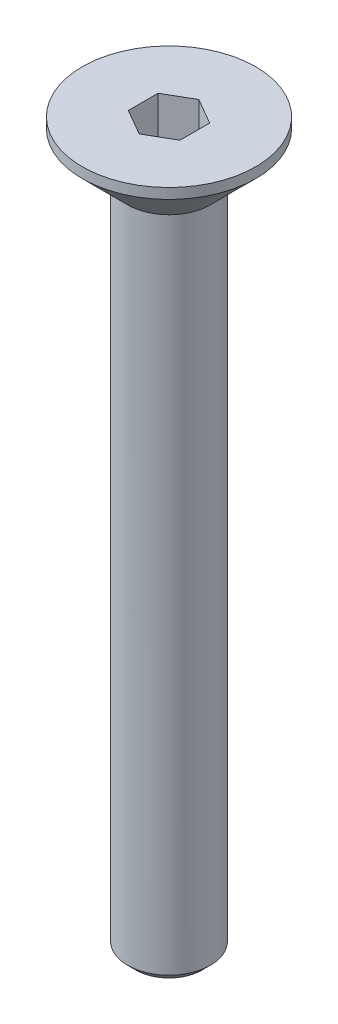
ISO-10303-21;
HEADER;
FILE_DESCRIPTION(('STEP AP214'),'2;1');
FILE_NAME('part.step','',(''),(''),'','','');
FILE_SCHEMA(('AUTOMOTIVE_DESIGN { 1 0 10303 214 1 1 1 1 }'));
ENDSEC;
DATA;
#1=APPLICATION_CONTEXT('core data for automotive mechanical design processes');
#2=APPLICATION_PROTOCOL_DEFINITION('international standard','automotive_design',2000,#1);
#3=PRODUCT_CONTEXT('',#1,'mechanical');
#4=PRODUCT('Part','Part','',(#3));
#5=PRODUCT_RELATED_PRODUCT_CATEGORY('part','',(#4));
#6=PRODUCT_DEFINITION_FORMATION('','',#4);
#7=PRODUCT_DEFINITION_CONTEXT('part definition',#1,'design');
#8=PRODUCT_DEFINITION('design','',#6,#7);
#9=PRODUCT_DEFINITION_SHAPE('','',#8);
#10=(LENGTH_UNIT() NAMED_UNIT(*) SI_UNIT(.MILLI.,.METRE.));
#11=(NAMED_UNIT(*) PLANE_ANGLE_UNIT() SI_UNIT($,.RADIAN.));
#12=(NAMED_UNIT(*) SI_UNIT($,.STERADIAN.) SOLID_ANGLE_UNIT());
#13=UNCERTAINTY_MEASURE_WITH_UNIT(LENGTH_MEASURE(1.E-05),#10,'distance_accuracy_value','');
#14=(GEOMETRIC_REPRESENTATION_CONTEXT(3) GLOBAL_UNCERTAINTY_ASSIGNED_CONTEXT((#13)) GLOBAL_UNIT_ASSIGNED_CONTEXT((#10,
#11,#12)) REPRESENTATION_CONTEXT('',''));
#15=CARTESIAN_POINT('',(0.,0.,0.));
#16=DIRECTION('',(0.,0.,1.));
#17=DIRECTION('',(1.,0.,0.));
#18=AXIS2_PLACEMENT_3D('',#15,#16,#17);
#19=CARTESIAN_POINT('',(-1.25,0.,0.721687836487));
#20=DIRECTION('',(-0.500000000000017,0.,0.866025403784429));
#21=DIRECTION('',(0.866025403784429,0.,0.500000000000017));
#22=AXIS2_PLACEMENT_3D('',#19,#20,#21);
#23=PLANE('',#22);
#24=DIRECTION('',(0.866025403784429,0.,0.500000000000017));
#25=VECTOR('',#24,1.);
#26=CARTESIAN_POINT('',(-1.25,-3.,0.721687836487));
#27=LINE('',#26,#25);
#28=CARTESIAN_POINT('',(-1.25,-3.,0.721687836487));
#29=VERTEX_POINT('',#28);
#30=CARTESIAN_POINT('',(0.,-3.,1.44337567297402));
#31=VERTEX_POINT('',#30);
#32=EDGE_CURVE('E66',#29,#31,#27,.T.);
#33=ORIENTED_EDGE('',*,*,#32,.F.);
#34=DIRECTION('',(0.,1.,0.));
#35=VECTOR('',#34,1.);
#36=CARTESIAN_POINT('',(-1.25,0.,0.721687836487));
#37=LINE('',#36,#35);
#38=CARTESIAN_POINT('',(-1.25,0.,0.721687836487));
#39=VERTEX_POINT('',#38);
#40=EDGE_CURVE('E92',#29,#39,#37,.T.);
#41=ORIENTED_EDGE('',*,*,#40,.T.);
#42=DIRECTION('',(0.866025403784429,0.,0.500000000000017));
#43=VECTOR('',#42,1.);
#44=CARTESIAN_POINT('',(-1.25,0.,0.721687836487));
#45=LINE('',#44,#43);
#46=CARTESIAN_POINT('',(0.,0.,1.44337567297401));
#47=VERTEX_POINT('',#46);
#48=EDGE_CURVE('E79',#47,#39,#45,.F.);
#49=ORIENTED_EDGE('',*,*,#48,.F.);
#50=DIRECTION('',(0.,1.,0.));
#51=VECTOR('',#50,1.);
#52=CARTESIAN_POINT('',(0.,0.,1.44337567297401));
#53=LINE('',#52,#51);
#54=EDGE_CURVE('E83',#47,#31,#53,.F.);
#55=ORIENTED_EDGE('',*,*,#54,.T.);
#56=EDGE_LOOP('',(#33,#41,#49,#55));
#57=FACE_BOUND('',#56,.T.);
#58=ADVANCED_FACE('F16',(#57),#23,.F.);
#59=CARTESIAN_POINT('',(0.,0.,1.443375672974));
#60=DIRECTION('',(0.500000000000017,0.,0.866025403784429));
#61=DIRECTION('',(0.866025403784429,0.,-0.500000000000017));
#62=AXIS2_PLACEMENT_3D('',#59,#60,#61);
#63=PLANE('',#62);
#64=DIRECTION('',(0.866025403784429,0.,-0.500000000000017));
#65=VECTOR('',#64,1.);
#66=CARTESIAN_POINT('',(0.,-3.,1.443375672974));
#67=LINE('',#66,#65);
#68=CARTESIAN_POINT('',(1.24999999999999,-3.,0.721687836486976));
#69=VERTEX_POINT('',#68);
#70=EDGE_CURVE('E71',#31,#69,#67,.T.);
#71=ORIENTED_EDGE('',*,*,#70,.F.);
#72=ORIENTED_EDGE('',*,*,#54,.F.);
#73=DIRECTION('',(0.866025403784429,0.,-0.500000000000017));
#74=VECTOR('',#73,1.);
#75=CARTESIAN_POINT('',(0.,0.,1.443375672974));
#76=LINE('',#75,#74);
#77=CARTESIAN_POINT('',(1.24999999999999,0.,0.721687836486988));
#78=VERTEX_POINT('',#77);
#79=EDGE_CURVE('E78',#78,#47,#76,.F.);
#80=ORIENTED_EDGE('',*,*,#79,.F.);
#81=DIRECTION('',(0.,1.,0.));
#82=VECTOR('',#81,1.);
#83=CARTESIAN_POINT('',(1.25,0.,0.721687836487));
#84=LINE('',#83,#82);
#85=EDGE_CURVE('E88',#78,#69,#84,.F.);
#86=ORIENTED_EDGE('',*,*,#85,.T.);
#87=EDGE_LOOP('',(#71,#72,#80,#86));
#88=FACE_BOUND('',#87,.T.);
#89=ADVANCED_FACE('F87',(#88),#63,.F.);
#90=CARTESIAN_POINT('',(-1.25,0.,-0.721687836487));
#91=DIRECTION('',(-1.,0.,0.));
#92=DIRECTION('',(0.,0.,1.));
#93=AXIS2_PLACEMENT_3D('',#90,#91,#92);
#94=PLANE('',#93);
#95=DIRECTION('',(0.,0.,1.));
#96=VECTOR('',#95,1.);
#97=CARTESIAN_POINT('',(-1.25,-3.,0.));
#98=LINE('',#97,#96);
#99=CARTESIAN_POINT('',(-1.24999999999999,-3.,-0.721687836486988));
#100=VERTEX_POINT('',#99);
#101=EDGE_CURVE('E74',#100,#29,#98,.T.);
#102=ORIENTED_EDGE('',*,*,#101,.F.);
#103=DIRECTION('',(0.,1.,0.));
#104=VECTOR('',#103,1.);
#105=CARTESIAN_POINT('',(-1.24999999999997,0.,-0.721687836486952));
#106=LINE('',#105,#104);
#107=CARTESIAN_POINT('',(-1.24999999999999,0.,-0.721687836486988));
#108=VERTEX_POINT('',#107);
#109=EDGE_CURVE('E104',#100,#108,#106,.T.);
#110=ORIENTED_EDGE('',*,*,#109,.T.);
#111=DIRECTION('',(0.,0.,1.));
#112=VECTOR('',#111,1.);
#113=CARTESIAN_POINT('',(-1.25,0.,-0.721687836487));
#114=LINE('',#113,#112);
#115=EDGE_CURVE('E90',#39,#108,#114,.F.);
#116=ORIENTED_EDGE('',*,*,#115,.F.);
#117=ORIENTED_EDGE('',*,*,#40,.F.);
#118=EDGE_LOOP('',(#102,#110,#116,#117));
#119=FACE_BOUND('',#118,.T.);
#120=ADVANCED_FACE('F213',(#119),#94,.F.);
#121=CARTESIAN_POINT('',(1.25,0.,0.721687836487));
#122=DIRECTION('',(1.,0.,0.));
#123=DIRECTION('',(0.,0.,-1.));
#124=AXIS2_PLACEMENT_3D('',#121,#122,#123);
#125=PLANE('',#124);
#126=DIRECTION('',(0.,0.,1.));
#127=VECTOR('',#126,1.);
#128=CARTESIAN_POINT('',(1.25,-3.,0.));
#129=LINE('',#128,#127);
#130=CARTESIAN_POINT('',(1.25,-3.,-0.721687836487));
#131=VERTEX_POINT('',#130);
#132=EDGE_CURVE('E100',#69,#131,#129,.F.);
#133=ORIENTED_EDGE('',*,*,#132,.F.);
#134=ORIENTED_EDGE('',*,*,#85,.F.);
#135=DIRECTION('',(0.,0.,-1.));
#136=VECTOR('',#135,1.);
#137=CARTESIAN_POINT('',(1.25,0.,0.721687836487));
#138=LINE('',#137,#136);
#139=CARTESIAN_POINT('',(1.25,0.,-0.721687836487));
#140=VERTEX_POINT('',#139);
#141=EDGE_CURVE('E33',#140,#78,#138,.F.);
#142=ORIENTED_EDGE('',*,*,#141,.F.);
#143=DIRECTION('',(0.,1.,0.));
#144=VECTOR('',#143,1.);
#145=CARTESIAN_POINT('',(1.25,0.,-0.721687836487));
#146=LINE('',#145,#144);
#147=EDGE_CURVE('E107',#140,#131,#146,.F.);
#148=ORIENTED_EDGE('',*,*,#147,.T.);
#149=EDGE_LOOP('',(#133,#134,#142,#148));
#150=FACE_BOUND('',#149,.T.);
#151=ADVANCED_FACE('F206',(#150),#125,.F.);
#152=CARTESIAN_POINT('',(0.,-3.,0.));
#153=DIRECTION('',(0.,1.,0.));
#154=DIRECTION('',(0.,0.,1.));
#155=AXIS2_PLACEMENT_3D('',#152,#153,#154);
#156=PLANE('',#155);
#157=DIRECTION('',(-0.866025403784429,0.,-0.500000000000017));
#158=VECTOR('',#157,1.);
#159=CARTESIAN_POINT('',(1.25,-3.,-0.721687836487));
#160=LINE('',#159,#158);
#161=CARTESIAN_POINT('',(0.,-3.,-1.44337567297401));
#162=VERTEX_POINT('',#161);
#163=EDGE_CURVE('E115',#131,#162,#160,.T.);
#164=ORIENTED_EDGE('',*,*,#163,.T.);
#165=DIRECTION('',(-0.866025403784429,0.,0.500000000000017));
#166=VECTOR('',#165,1.);
#167=CARTESIAN_POINT('',(0.,-3.,-1.443375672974));
#168=LINE('',#167,#166);
#169=EDGE_CURVE('E108',#162,#100,#168,.T.);
#170=ORIENTED_EDGE('',*,*,#169,.T.);
#171=ORIENTED_EDGE('',*,*,#101,.T.);
#172=ORIENTED_EDGE('',*,*,#32,.T.);
#173=ORIENTED_EDGE('',*,*,#70,.T.);
#174=ORIENTED_EDGE('',*,*,#132,.T.);
#175=EDGE_LOOP('',(#164,#170,#171,#172,#173,#174));
#176=FACE_BOUND('',#175,.T.);
#177=ADVANCED_FACE('F68',(#176),#156,.T.);
#178=CARTESIAN_POINT('',(0.,0.,-1.443375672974));
#179=DIRECTION('',(-0.500000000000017,0.,-0.866025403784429));
#180=DIRECTION('',(-0.866025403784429,0.,0.500000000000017));
#181=AXIS2_PLACEMENT_3D('',#178,#179,#180);
#182=PLANE('',#181);
#183=ORIENTED_EDGE('',*,*,#169,.F.);
#184=DIRECTION('',(0.,1.,0.));
#185=VECTOR('',#184,1.);
#186=CARTESIAN_POINT('',(0.,0.,-1.44337567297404));
#187=LINE('',#186,#185);
#188=CARTESIAN_POINT('',(0.,0.,-1.44337567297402));
#189=VERTEX_POINT('',#188);
#190=EDGE_CURVE('E111',#162,#189,#187,.T.);
#191=ORIENTED_EDGE('',*,*,#190,.T.);
#192=DIRECTION('',(-0.866025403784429,0.,0.500000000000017));
#193=VECTOR('',#192,1.);
#194=CARTESIAN_POINT('',(0.,0.,-1.443375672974));
#195=LINE('',#194,#193);
#196=EDGE_CURVE('E102',#108,#189,#195,.F.);
#197=ORIENTED_EDGE('',*,*,#196,.F.);
#198=ORIENTED_EDGE('',*,*,#109,.F.);
#199=EDGE_LOOP('',(#183,#191,#197,#198));
#200=FACE_BOUND('',#199,.T.);
#201=ADVANCED_FACE('F191',(#200),#182,.F.);
#202=CARTESIAN_POINT('',(1.25,0.,-0.721687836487));
#203=DIRECTION('',(0.500000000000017,0.,-0.866025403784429));
#204=DIRECTION('',(-0.866025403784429,0.,-0.500000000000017));
#205=AXIS2_PLACEMENT_3D('',#202,#203,#204);
#206=PLANE('',#205);
#207=ORIENTED_EDGE('',*,*,#163,.F.);
#208=ORIENTED_EDGE('',*,*,#147,.F.);
#209=DIRECTION('',(-0.866025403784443,0.,-0.499999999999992));
#210=VECTOR('',#209,1.);
#211=CARTESIAN_POINT('',(1.25,0.,-0.721687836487));
#212=LINE('',#211,#210);
#213=EDGE_CURVE('E114',#140,#189,#212,.T.);
#214=ORIENTED_EDGE('',*,*,#213,.T.);
#215=ORIENTED_EDGE('',*,*,#190,.F.);
#216=EDGE_LOOP('',(#207,#208,#214,#215));
#217=FACE_BOUND('',#216,.T.);
#218=ADVANCED_FACE('F183',(#217),#206,.F.);
#219=CARTESIAN_POINT('',(0.,0.,0.));
#220=DIRECTION('',(0.,-1.,0.));
#221=DIRECTION('',(0.,0.,-1.));
#222=AXIS2_PLACEMENT_3D('',#219,#220,#221);
#223=PLANE('',#222);
#224=ORIENTED_EDGE('',*,*,#141,.T.);
#225=ORIENTED_EDGE('',*,*,#79,.T.);
#226=ORIENTED_EDGE('',*,*,#48,.T.);
#227=ORIENTED_EDGE('',*,*,#115,.T.);
#228=ORIENTED_EDGE('',*,*,#196,.T.);
#229=ORIENTED_EDGE('',*,*,#213,.F.);
#230=EDGE_LOOP('',(#224,#225,#226,#227,#228,#229));
#231=FACE_BOUND('',#230,.T.);
#232=CARTESIAN_POINT('',(0.,0.,0.));
#233=DIRECTION('',(0.,-1.,0.));
#234=DIRECTION('',(0.,0.,-1.));
#235=AXIS2_PLACEMENT_3D('',#232,#233,#234);
#236=CIRCLE('',#235,4.2);
#237=CARTESIAN_POINT('',(0.,0.,-4.2));
#238=VERTEX_POINT('',#237);
#239=EDGE_CURVE('E20',#238,#238,#236,.T.);
#240=ORIENTED_EDGE('',*,*,#239,.F.);
#241=EDGE_LOOP('',(#240));
#242=FACE_BOUND('',#241,.T.);
#243=ADVANCED_FACE('F147',(#231,#242),#223,.F.);
#244=CARTESIAN_POINT('',(0.,1.75,0.));
#245=DIRECTION('',(0.,-1.,0.));
#246=DIRECTION('',(0.,0.,-1.));
#247=AXIS2_PLACEMENT_3D('',#244,#245,#246);
#248=CYLINDRICAL_SURFACE('',#247,4.2);
#249=ORIENTED_EDGE('',*,*,#239,.T.);
#250=EDGE_LOOP('',(#249));
#251=FACE_BOUND('',#250,.T.);
#252=CARTESIAN_POINT('',(0.,-0.499999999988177,0.));
#253=DIRECTION('',(0.,1.,0.));
#254=DIRECTION('',(1.,0.,0.));
#255=AXIS2_PLACEMENT_3D('',#252,#253,#254);
#256=CIRCLE('',#255,4.20000000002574);
#257=CARTESIAN_POINT('',(4.20000000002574,-0.499999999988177,0.));
#258=VERTEX_POINT('',#257);
#259=EDGE_CURVE('E123',#258,#258,#256,.F.);
#260=ORIENTED_EDGE('',*,*,#259,.F.);
#261=EDGE_LOOP('',(#260));
#262=FACE_BOUND('',#261,.T.);
#263=ADVANCED_FACE('F138',(#251,#262),#248,.T.);
#264=CARTESIAN_POINT('',(0.,-35.,0.));
#265=DIRECTION('',(0.,-1.,0.));
#266=DIRECTION('',(0.,0.,-1.));
#267=AXIS2_PLACEMENT_3D('',#264,#265,#266);
#268=PLANE('',#267);
#269=CARTESIAN_POINT('',(0.,-35.,0.));
#270=DIRECTION('',(0.,-1.,0.));
#271=DIRECTION('',(0.,0.,-1.));
#272=AXIS2_PLACEMENT_3D('',#269,#270,#271);
#273=CIRCLE('',#272,1.59997085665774);
#274=CARTESIAN_POINT('',(0.,-35.,-1.59997085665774));
#275=VERTEX_POINT('',#274);
#276=EDGE_CURVE('E122',#275,#275,#273,.F.);
#277=ORIENTED_EDGE('',*,*,#276,.F.);
#278=EDGE_LOOP('',(#277));
#279=FACE_BOUND('',#278,.T.);
#280=ADVANCED_FACE('F135',(#279),#268,.T.);
#281=CARTESIAN_POINT('',(0.,-0.499999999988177,0.));
#282=DIRECTION('',(0.,1.,0.));
#283=DIRECTION('',(0.,0.,1.));
#284=AXIS2_PLACEMENT_3D('',#281,#282,#283);
#285=CONICAL_SURFACE('',#284,4.20000000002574,0.785398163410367);
#286=ORIENTED_EDGE('',*,*,#259,.T.);
#287=EDGE_LOOP('',(#286));
#288=FACE_BOUND('',#287,.T.);
#289=CARTESIAN_POINT('',(0.,-2.7,0.));
#290=DIRECTION('',(0.,-1.,0.));
#291=DIRECTION('',(0.,0.,-1.));
#292=AXIS2_PLACEMENT_3D('',#289,#290,#291);
#293=CIRCLE('',#292,2.);
#294=CARTESIAN_POINT('',(0.,-2.7,-2.));
#295=VERTEX_POINT('',#294);
#296=EDGE_CURVE('E26',#295,#295,#293,.T.);
#297=ORIENTED_EDGE('',*,*,#296,.F.);
#298=EDGE_LOOP('',(#297));
#299=FACE_BOUND('',#298,.T.);
#300=ADVANCED_FACE('F137',(#288,#299),#285,.T.);
#301=CARTESIAN_POINT('',(0.,-34.599980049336,0.));
#302=DIRECTION('',(0.,1.,0.));
#303=DIRECTION('',(0.,0.,1.));
#304=AXIS2_PLACEMENT_3D('',#301,#302,#303);
#305=CONICAL_SURFACE('',#304,1.99998352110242,0.785389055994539);
#306=ORIENTED_EDGE('',*,*,#276,.T.);
#307=EDGE_LOOP('',(#306));
#308=FACE_BOUND('',#307,.T.);
#309=CARTESIAN_POINT('',(0.,-34.5999635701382,0.));
#310=DIRECTION('',(0.,1.,0.));
#311=DIRECTION('',(0.,0.,1.));
#312=AXIS2_PLACEMENT_3D('',#309,#310,#311);
#313=CIRCLE('',#312,2.);
#314=CARTESIAN_POINT('',(0.,-34.5999635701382,2.));
#315=VERTEX_POINT('',#314);
#316=EDGE_CURVE('E11',#315,#315,#313,.T.);
#317=ORIENTED_EDGE('',*,*,#316,.F.);
#318=EDGE_LOOP('',(#317));
#319=FACE_BOUND('',#318,.T.);
#320=ADVANCED_FACE('F132',(#308,#319),#305,.T.);
#321=CARTESIAN_POINT('',(0.,1.75,0.));
#322=DIRECTION('',(0.,-1.,0.));
#323=DIRECTION('',(0.,0.,-1.));
#324=AXIS2_PLACEMENT_3D('',#321,#322,#323);
#325=CYLINDRICAL_SURFACE('',#324,2.);
#326=ORIENTED_EDGE('',*,*,#296,.T.);
#327=EDGE_LOOP('',(#326));
#328=FACE_BOUND('',#327,.T.);
#329=ORIENTED_EDGE('',*,*,#316,.T.);
#330=EDGE_LOOP('',(#329));
#331=FACE_BOUND('',#330,.T.);
#332=ADVANCED_FACE('F18',(#328,#331),#325,.T.);
#333=CLOSED_SHELL('',(#58,#89,#120,#151,#177,#201,#218,#243,#263,#280,#300,#320,#332));
#334=MANIFOLD_SOLID_BREP('B1',#333);
#335=ADVANCED_BREP_SHAPE_REPRESENTATION('',(#18,#334),#14);
#336=SHAPE_DEFINITION_REPRESENTATION(#9,#335);
ENDSEC;
END-ISO-10303-21;
